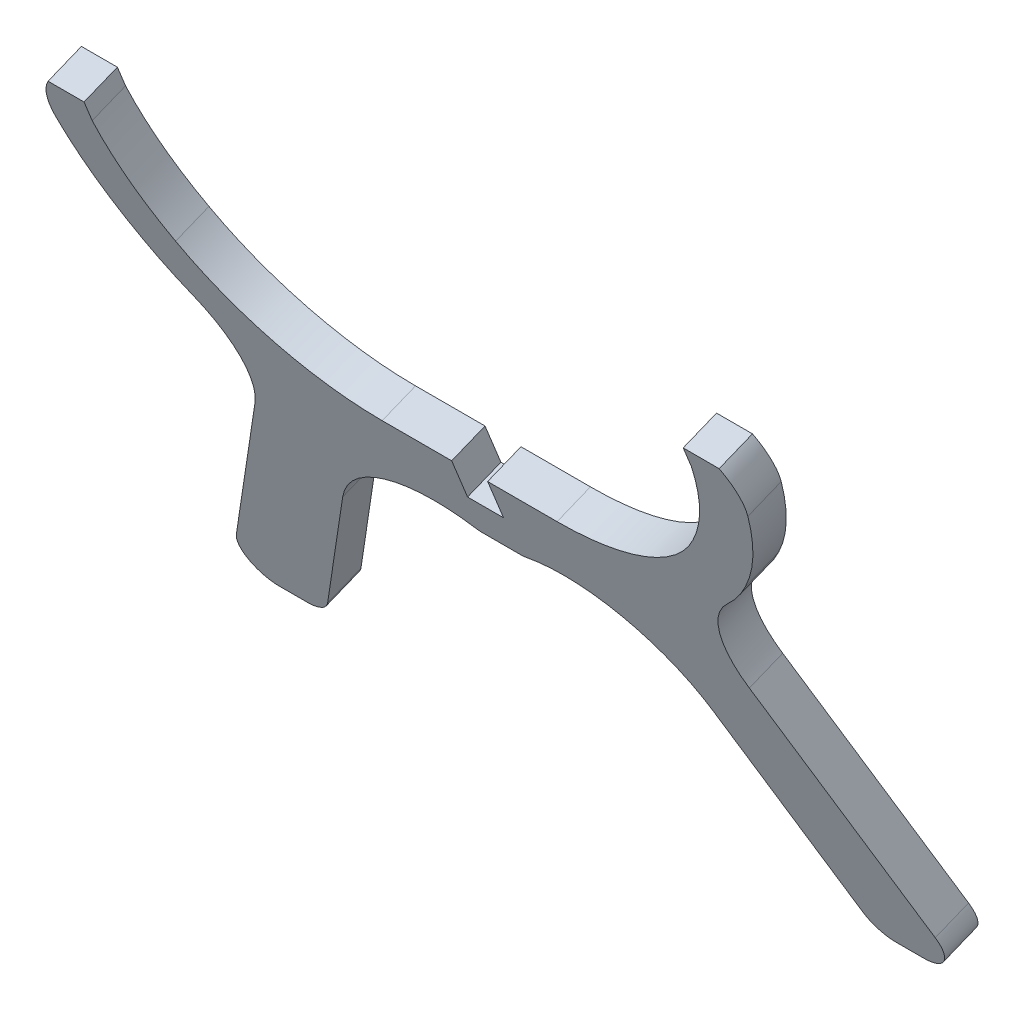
ISO-10303-21;
HEADER;
FILE_DESCRIPTION(('STEP AP214'),'2;1');
FILE_NAME('part.step','',(''),(''),'','','');
FILE_SCHEMA(('AUTOMOTIVE_DESIGN { 1 0 10303 214 1 1 1 1 }'));
ENDSEC;
DATA;
#1=APPLICATION_CONTEXT('core data for automotive mechanical design processes');
#2=APPLICATION_PROTOCOL_DEFINITION('international standard','automotive_design',2000,#1);
#3=PRODUCT_CONTEXT('',#1,'mechanical');
#4=PRODUCT('Part','Part','',(#3));
#5=PRODUCT_RELATED_PRODUCT_CATEGORY('part','',(#4));
#6=PRODUCT_DEFINITION_FORMATION('','',#4);
#7=PRODUCT_DEFINITION_CONTEXT('part definition',#1,'design');
#8=PRODUCT_DEFINITION('design','',#6,#7);
#9=PRODUCT_DEFINITION_SHAPE('','',#8);
#10=(LENGTH_UNIT() NAMED_UNIT(*) SI_UNIT(.MILLI.,.METRE.));
#11=(NAMED_UNIT(*) PLANE_ANGLE_UNIT() SI_UNIT($,.RADIAN.));
#12=(NAMED_UNIT(*) SI_UNIT($,.STERADIAN.) SOLID_ANGLE_UNIT());
#13=UNCERTAINTY_MEASURE_WITH_UNIT(LENGTH_MEASURE(1.E-05),#10,'distance_accuracy_value','');
#14=(GEOMETRIC_REPRESENTATION_CONTEXT(3) GLOBAL_UNCERTAINTY_ASSIGNED_CONTEXT((#13)) GLOBAL_UNIT_ASSIGNED_CONTEXT((#10,
#11,#12)) REPRESENTATION_CONTEXT('',''));
#15=CARTESIAN_POINT('',(0.,0.,0.));
#16=DIRECTION('',(0.,0.,1.));
#17=DIRECTION('',(1.,0.,0.));
#18=AXIS2_PLACEMENT_3D('',#15,#16,#17);
#19=CARTESIAN_POINT('',(35.9135850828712,-188.81571690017,-95.7001268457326));
#20=DIRECTION('',(0.,-0.374606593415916,0.927183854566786));
#21=DIRECTION('',(0.,-0.927183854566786,-0.374606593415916));
#22=AXIS2_PLACEMENT_3D('',#19,#20,#21);
#23=CYLINDRICAL_SURFACE('',#22,265.895482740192);
#24=CARTESIAN_POINT('',(35.9135850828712,-202.301554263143,-62.3215080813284));
#25=DIRECTION('',(0.,-0.374606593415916,0.927183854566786));
#26=DIRECTION('',(0.,0.927183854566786,0.374606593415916));
#27=AXIS2_PLACEMENT_3D('',#24,#25,#26);
#28=CIRCLE('',#27,265.895482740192);
#29=CARTESIAN_POINT('',(259.051263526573,-336.374982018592,-116.490689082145));
#30=VERTEX_POINT('',#29);
#31=CARTESIAN_POINT('',(300.,-231.010933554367,-73.9208502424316));
#32=VERTEX_POINT('',#31);
#33=EDGE_CURVE('E297',#30,#32,#28,.T.);
#34=ORIENTED_EDGE('',*,*,#33,.T.);
#35=DIRECTION('',(0.,-0.374606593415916,0.927183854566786));
#36=VECTOR('',#35,1.);
#37=CARTESIAN_POINT('',(300.,-217.525096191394,-107.299469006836));
#38=LINE('',#37,#36);
#39=CARTESIAN_POINT('',(300.,-217.525096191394,-107.299469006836));
#40=VERTEX_POINT('',#39);
#41=EDGE_CURVE('E11',#40,#32,#38,.T.);
#42=ORIENTED_EDGE('',*,*,#41,.F.);
#43=CARTESIAN_POINT('',(35.9135850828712,-188.81571690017,-95.7001268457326));
#44=DIRECTION('',(0.,-0.374606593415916,0.927183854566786));
#45=DIRECTION('',(0.,0.927183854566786,0.374606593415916));
#46=AXIS2_PLACEMENT_3D('',#43,#44,#45);
#47=CIRCLE('',#46,265.895482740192);
#48=CARTESIAN_POINT('',(259.051263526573,-322.889144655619,-149.86930784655));
#49=VERTEX_POINT('',#48);
#50=EDGE_CURVE('E367',#49,#40,#47,.T.);
#51=ORIENTED_EDGE('',*,*,#50,.F.);
#52=DIRECTION('',(0.,-0.374606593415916,0.927183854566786));
#53=VECTOR('',#52,1.);
#54=CARTESIAN_POINT('',(259.051263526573,-322.889144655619,-149.86930784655));
#55=LINE('',#54,#53);
#56=EDGE_CURVE('E293',#49,#30,#55,.T.);
#57=ORIENTED_EDGE('',*,*,#56,.T.);
#58=EDGE_LOOP('',(#34,#42,#51,#57));
#59=FACE_BOUND('',#58,.T.);
#60=ADVANCED_FACE('F33',(#59),#23,.F.);
#61=CARTESIAN_POINT('',(300.,-217.525096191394,-107.299469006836));
#62=DIRECTION('',(1.,0.,0.));
#63=DIRECTION('',(0.,0.,-1.));
#64=AXIS2_PLACEMENT_3D('',#61,#62,#63);
#65=PLANE('',#64);
#66=DIRECTION('',(0.,0.927183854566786,0.374606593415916));
#67=VECTOR('',#66,1.);
#68=CARTESIAN_POINT('',(300.,-231.010933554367,-73.9208502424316));
#69=LINE('',#68,#67);
#70=CARTESIAN_POINT('',(300.,-210.723366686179,-65.7241411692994));
#71=VERTEX_POINT('',#70);
#72=EDGE_CURVE('E300',#32,#71,#69,.T.);
#73=ORIENTED_EDGE('',*,*,#72,.T.);
#74=DIRECTION('',(0.,-0.374606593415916,0.927183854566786));
#75=VECTOR('',#74,1.);
#76=CARTESIAN_POINT('',(300.,-197.237529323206,-99.1027599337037));
#77=LINE('',#76,#75);
#78=CARTESIAN_POINT('',(300.,-197.237529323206,-99.1027599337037));
#79=VERTEX_POINT('',#78);
#80=EDGE_CURVE('E41',#79,#71,#77,.T.);
#81=ORIENTED_EDGE('',*,*,#80,.F.);
#82=DIRECTION('',(0.,0.927183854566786,0.374606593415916));
#83=VECTOR('',#82,1.);
#84=CARTESIAN_POINT('',(300.,-217.525096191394,-107.299469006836));
#85=LINE('',#84,#83);
#86=EDGE_CURVE('E176',#40,#79,#85,.T.);
#87=ORIENTED_EDGE('',*,*,#86,.F.);
#88=ORIENTED_EDGE('',*,*,#41,.T.);
#89=EDGE_LOOP('',(#73,#81,#87,#88));
#90=FACE_BOUND('',#89,.T.);
#91=ADVANCED_FACE('F565',(#90),#65,.F.);
#92=CARTESIAN_POINT('',(300.,-197.237529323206,-99.1027599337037));
#93=DIRECTION('',(0.,-0.927183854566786,-0.374606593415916));
#94=DIRECTION('',(0.,0.374606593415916,-0.927183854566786));
#95=AXIS2_PLACEMENT_3D('',#92,#93,#94);
#96=PLANE('',#95);
#97=DIRECTION('',(1.,0.,0.));
#98=VECTOR('',#97,1.);
#99=CARTESIAN_POINT('',(300.,-210.723366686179,-65.7241411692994));
#100=LINE('',#99,#98);
#101=CARTESIAN_POINT('',(336.,-210.723366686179,-65.7241411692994));
#102=VERTEX_POINT('',#101);
#103=EDGE_CURVE('E302',#71,#102,#100,.T.);
#104=ORIENTED_EDGE('',*,*,#103,.T.);
#105=DIRECTION('',(0.,-0.374606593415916,0.927183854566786));
#106=VECTOR('',#105,1.);
#107=CARTESIAN_POINT('',(336.,-197.237529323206,-99.1027599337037));
#108=LINE('',#107,#106);
#109=CARTESIAN_POINT('',(336.,-197.237529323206,-99.1027599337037));
#110=VERTEX_POINT('',#109);
#111=EDGE_CURVE('E458',#110,#102,#108,.T.);
#112=ORIENTED_EDGE('',*,*,#111,.F.);
#113=DIRECTION('',(1.,0.,0.));
#114=VECTOR('',#113,1.);
#115=CARTESIAN_POINT('',(300.,-197.237529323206,-99.1027599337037));
#116=LINE('',#115,#114);
#117=EDGE_CURVE('E466',#79,#110,#116,.T.);
#118=ORIENTED_EDGE('',*,*,#117,.F.);
#119=ORIENTED_EDGE('',*,*,#80,.T.);
#120=EDGE_LOOP('',(#104,#112,#118,#119));
#121=FACE_BOUND('',#120,.T.);
#122=ADVANCED_FACE('F464',(#121),#96,.F.);
#123=CARTESIAN_POINT('',(282.577068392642,-231.518029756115,-112.952981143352));
#124=DIRECTION('',(0.,-0.374606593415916,0.927183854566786));
#125=DIRECTION('',(0.,-0.927183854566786,-0.374606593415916));
#126=AXIS2_PLACEMENT_3D('',#123,#124,#125);
#127=CYLINDRICAL_SURFACE('',#126,64.9691539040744);
#128=CARTESIAN_POINT('',(282.577068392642,-245.003867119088,-79.574362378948));
#129=DIRECTION('',(0.,0.374606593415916,-0.927183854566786));
#130=DIRECTION('',(0.,0.927183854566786,0.374606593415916));
#131=AXIS2_PLACEMENT_3D('',#128,#129,#130);
#132=CIRCLE('',#131,64.9691539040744);
#133=CARTESIAN_POINT('',(346.44249807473,-256.060232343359,-84.0414238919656));
#134=VERTEX_POINT('',#133);
#135=EDGE_CURVE('E304',#102,#134,#132,.T.);
#136=ORIENTED_EDGE('',*,*,#135,.T.);
#137=DIRECTION('',(0.,-0.374606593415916,0.927183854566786));
#138=VECTOR('',#137,1.);
#139=CARTESIAN_POINT('',(346.44249807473,-242.574394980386,-117.42004265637));
#140=LINE('',#139,#138);
#141=CARTESIAN_POINT('',(346.44249807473,-242.574394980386,-117.42004265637));
#142=VERTEX_POINT('',#141);
#143=EDGE_CURVE('E455',#142,#134,#140,.T.);
#144=ORIENTED_EDGE('',*,*,#143,.F.);
#145=CARTESIAN_POINT('',(282.577068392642,-231.518029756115,-112.952981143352));
#146=DIRECTION('',(0.,0.374606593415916,-0.927183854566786));
#147=DIRECTION('',(0.,0.927183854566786,0.374606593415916));
#148=AXIS2_PLACEMENT_3D('',#145,#146,#147);
#149=CIRCLE('',#148,64.9691539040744);
#150=EDGE_CURVE('E484',#110,#142,#149,.T.);
#151=ORIENTED_EDGE('',*,*,#150,.F.);
#152=ORIENTED_EDGE('',*,*,#111,.T.);
#153=EDGE_LOOP('',(#136,#144,#151,#152));
#154=FACE_BOUND('',#153,.T.);
#155=ADVANCED_FACE('F475',(#154),#127,.T.);
#156=CARTESIAN_POINT('',(35.9135850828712,-188.81571690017,-95.7001268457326));
#157=DIRECTION('',(0.,-0.374606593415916,0.927183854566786));
#158=DIRECTION('',(0.,-0.927183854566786,-0.374606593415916));
#159=AXIS2_PLACEMENT_3D('',#156,#157,#158);
#160=CYLINDRICAL_SURFACE('',#159,315.895482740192);
#161=CARTESIAN_POINT('',(35.9135850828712,-202.301554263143,-62.3215080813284));
#162=DIRECTION('',(0.,0.374606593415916,-0.927183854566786));
#163=DIRECTION('',(0.,0.927183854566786,0.374606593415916));
#164=AXIS2_PLACEMENT_3D('',#161,#162,#163);
#165=CIRCLE('',#164,315.895482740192);
#166=CARTESIAN_POINT('',(301.164181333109,-361.367172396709,-126.58818943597));
#167=VERTEX_POINT('',#166);
#168=EDGE_CURVE('E306',#134,#167,#165,.T.);
#169=ORIENTED_EDGE('',*,*,#168,.T.);
#170=DIRECTION('',(0.,-0.374606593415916,0.927183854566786));
#171=VECTOR('',#170,1.);
#172=CARTESIAN_POINT('',(301.164181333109,-347.881335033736,-159.966808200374));
#173=LINE('',#172,#171);
#174=CARTESIAN_POINT('',(301.164181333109,-347.881335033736,-159.966808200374));
#175=VERTEX_POINT('',#174);
#176=EDGE_CURVE('E452',#175,#167,#173,.T.);
#177=ORIENTED_EDGE('',*,*,#176,.F.);
#178=CARTESIAN_POINT('',(35.9135850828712,-188.81571690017,-95.7001268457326));
#179=DIRECTION('',(0.,0.374606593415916,-0.927183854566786));
#180=DIRECTION('',(0.,0.927183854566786,0.374606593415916));
#181=AXIS2_PLACEMENT_3D('',#178,#179,#180);
#182=CIRCLE('',#181,315.895482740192);
#183=EDGE_CURVE('E481',#142,#175,#182,.T.);
#184=ORIENTED_EDGE('',*,*,#183,.F.);
#185=ORIENTED_EDGE('',*,*,#143,.T.);
#186=EDGE_LOOP('',(#169,#177,#184,#185));
#187=FACE_BOUND('',#186,.T.);
#188=ADVANCED_FACE('F479',(#187),#160,.T.);
#189=CARTESIAN_POINT('',(87.5793017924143,-222.417987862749,-109.276325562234));
#190=DIRECTION('',(0.,-0.374606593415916,0.927183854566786));
#191=DIRECTION('',(0.,-0.927183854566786,-0.374606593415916));
#192=AXIS2_PLACEMENT_3D('',#189,#190,#191);
#193=CYLINDRICAL_SURFACE('',#192,252.842000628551);
#194=CARTESIAN_POINT('',(87.5793017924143,-235.903825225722,-75.8977067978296));
#195=DIRECTION('',(0.,0.374606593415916,-0.927183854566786));
#196=DIRECTION('',(0.,0.927183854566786,0.374606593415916));
#197=AXIS2_PLACEMENT_3D('',#194,#195,#196);
#198=CIRCLE('',#197,252.842000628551);
#199=CARTESIAN_POINT('',(267.327943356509,-400.774486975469,-142.509778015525));
#200=VERTEX_POINT('',#199);
#201=EDGE_CURVE('E308',#167,#200,#198,.T.);
#202=ORIENTED_EDGE('',*,*,#201,.T.);
#203=DIRECTION('',(0.,-0.374606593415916,0.927183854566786));
#204=VECTOR('',#203,1.);
#205=CARTESIAN_POINT('',(267.327943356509,-387.288649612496,-175.88839677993));
#206=LINE('',#205,#204);
#207=CARTESIAN_POINT('',(267.327943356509,-387.288649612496,-175.88839677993));
#208=VERTEX_POINT('',#207);
#209=EDGE_CURVE('E449',#208,#200,#206,.T.);
#210=ORIENTED_EDGE('',*,*,#209,.F.);
#211=CARTESIAN_POINT('',(87.5793017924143,-222.417987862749,-109.276325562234));
#212=DIRECTION('',(0.,0.374606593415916,-0.927183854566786));
#213=DIRECTION('',(0.,0.927183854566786,0.374606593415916));
#214=AXIS2_PLACEMENT_3D('',#211,#212,#213);
#215=CIRCLE('',#214,252.842000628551);
#216=EDGE_CURVE('E483',#175,#208,#215,.T.);
#217=ORIENTED_EDGE('',*,*,#216,.F.);
#218=ORIENTED_EDGE('',*,*,#176,.T.);
#219=EDGE_LOOP('',(#202,#210,#217,#218));
#220=FACE_BOUND('',#219,.T.);
#221=ADVANCED_FACE('F578',(#220),#193,.T.);
#222=CARTESIAN_POINT('',(338.419234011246,-452.495641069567,-202.233731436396));
#223=DIRECTION('',(0.,-0.374606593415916,0.927183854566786));
#224=DIRECTION('',(0.,-0.927183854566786,-0.374606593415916));
#225=AXIS2_PLACEMENT_3D('',#222,#223,#224);
#226=CYLINDRICAL_SURFACE('',#225,100.);
#227=CARTESIAN_POINT('',(338.419234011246,-465.98147843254,-168.855112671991));
#228=DIRECTION('',(0.,-0.374606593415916,0.927183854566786));
#229=DIRECTION('',(0.,0.927183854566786,0.374606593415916));
#230=AXIS2_PLACEMENT_3D('',#227,#228,#229);
#231=CIRCLE('',#230,100.);
#232=CARTESIAN_POINT('',(247.513299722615,-504.614139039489,-184.463720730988));
#233=VERTEX_POINT('',#232);
#234=EDGE_CURVE('E310',#200,#233,#231,.T.);
#235=ORIENTED_EDGE('',*,*,#234,.T.);
#236=DIRECTION('',(0.,-0.374606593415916,0.927183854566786));
#237=VECTOR('',#236,1.);
#238=CARTESIAN_POINT('',(247.513299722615,-491.128301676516,-217.842339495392));
#239=LINE('',#238,#237);
#240=CARTESIAN_POINT('',(247.513299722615,-491.128301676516,-217.842339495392));
#241=VERTEX_POINT('',#240);
#242=EDGE_CURVE('E446',#241,#233,#239,.T.);
#243=ORIENTED_EDGE('',*,*,#242,.F.);
#244=CARTESIAN_POINT('',(338.419234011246,-452.495641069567,-202.233731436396));
#245=DIRECTION('',(0.,-0.374606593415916,0.927183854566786));
#246=DIRECTION('',(0.,0.927183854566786,0.374606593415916));
#247=AXIS2_PLACEMENT_3D('',#244,#245,#246);
#248=CIRCLE('',#247,100.);
#249=EDGE_CURVE('E486',#208,#241,#248,.T.);
#250=ORIENTED_EDGE('',*,*,#249,.F.);
#251=ORIENTED_EDGE('',*,*,#209,.T.);
#252=EDGE_LOOP('',(#235,#243,#250,#251));
#253=FACE_BOUND('',#252,.T.);
#254=ADVANCED_FACE('F581',(#253),#226,.F.);
#255=CARTESIAN_POINT('',(247.513299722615,-491.128301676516,-217.842339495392));
#256=DIRECTION('',(-0.909059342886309,-0.386326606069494,-0.156086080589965));
#257=DIRECTION('',(0.391120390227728,-0.920339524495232,0.));
#258=AXIS2_PLACEMENT_3D('',#255,#256,#257);
#259=PLANE('',#258);
#260=DIRECTION('',(0.416666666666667,-0.842865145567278,-0.340539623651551));
#261=VECTOR('',#260,1.);
#262=CARTESIAN_POINT('',(247.513299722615,-504.614139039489,-184.463720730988));
#263=LINE('',#262,#261);
#264=CARTESIAN_POINT('',(349.946217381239,-711.82326556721,-268.181642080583));
#265=VERTEX_POINT('',#264);
#266=EDGE_CURVE('E312',#233,#265,#263,.T.);
#267=ORIENTED_EDGE('',*,*,#266,.T.);
#268=DIRECTION('',(0.,-0.374606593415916,0.927183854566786));
#269=VECTOR('',#268,1.);
#270=CARTESIAN_POINT('',(349.946217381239,-698.337428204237,-301.560260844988));
#271=LINE('',#270,#269);
#272=CARTESIAN_POINT('',(349.946217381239,-698.337428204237,-301.560260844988));
#273=VERTEX_POINT('',#272);
#274=EDGE_CURVE('E443',#273,#265,#271,.T.);
#275=ORIENTED_EDGE('',*,*,#274,.F.);
#276=DIRECTION('',(0.416666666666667,-0.842865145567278,-0.340539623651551));
#277=VECTOR('',#276,1.);
#278=CARTESIAN_POINT('',(247.513299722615,-491.128301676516,-217.842339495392));
#279=LINE('',#278,#277);
#280=EDGE_CURVE('E492',#241,#273,#279,.T.);
#281=ORIENTED_EDGE('',*,*,#280,.F.);
#282=ORIENTED_EDGE('',*,*,#242,.T.);
#283=EDGE_LOOP('',(#267,#275,#281,#282));
#284=FACE_BOUND('',#283,.T.);
#285=ADVANCED_FACE('F585',(#284),#259,.F.);
#286=CARTESIAN_POINT('',(322.67443709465,-709.927226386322,-306.242843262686));
#287=DIRECTION('',(0.,-0.374606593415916,0.927183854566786));
#288=DIRECTION('',(0.,-0.927183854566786,-0.374606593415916));
#289=AXIS2_PLACEMENT_3D('',#286,#287,#288);
#290=CYLINDRICAL_SURFACE('',#289,30.);
#291=CARTESIAN_POINT('',(322.67443709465,-723.413063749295,-272.864224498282));
#292=DIRECTION('',(0.,0.374606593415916,-0.927183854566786));
#293=DIRECTION('',(0.,0.927183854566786,0.374606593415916));
#294=AXIS2_PLACEMENT_3D('',#291,#292,#293);
#295=CIRCLE('',#294,30.);
#296=CARTESIAN_POINT('',(322.67443709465,-751.228579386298,-284.10242230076));
#297=VERTEX_POINT('',#296);
#298=EDGE_CURVE('E314',#265,#297,#295,.T.);
#299=ORIENTED_EDGE('',*,*,#298,.T.);
#300=DIRECTION('',(0.,-0.374606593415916,0.927183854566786));
#301=VECTOR('',#300,1.);
#302=CARTESIAN_POINT('',(322.67443709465,-737.742742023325,-317.481041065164));
#303=LINE('',#302,#301);
#304=CARTESIAN_POINT('',(322.67443709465,-737.742742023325,-317.481041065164));
#305=VERTEX_POINT('',#304);
#306=EDGE_CURVE('E440',#305,#297,#303,.T.);
#307=ORIENTED_EDGE('',*,*,#306,.F.);
#308=CARTESIAN_POINT('',(322.67443709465,-709.927226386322,-306.242843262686));
#309=DIRECTION('',(0.,0.374606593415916,-0.927183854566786));
#310=DIRECTION('',(0.,0.927183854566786,0.374606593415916));
#311=AXIS2_PLACEMENT_3D('',#308,#309,#310);
#312=CIRCLE('',#311,30.);
#313=EDGE_CURVE('E494',#273,#305,#312,.T.);
#314=ORIENTED_EDGE('',*,*,#313,.F.);
#315=ORIENTED_EDGE('',*,*,#274,.T.);
#316=EDGE_LOOP('',(#299,#307,#314,#315));
#317=FACE_BOUND('',#316,.T.);
#318=ADVANCED_FACE('F589',(#317),#290,.T.);
#319=CARTESIAN_POINT('',(322.67443709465,-737.742742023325,-317.481041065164));
#320=DIRECTION('',(0.,0.927183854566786,0.374606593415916));
#321=DIRECTION('',(0.,-0.374606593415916,0.927183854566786));
#322=AXIS2_PLACEMENT_3D('',#319,#320,#321);
#323=PLANE('',#322);
#324=DIRECTION('',(-1.,0.,0.));
#325=VECTOR('',#324,1.);
#326=CARTESIAN_POINT('',(322.67443709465,-751.228579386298,-284.10242230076));
#327=LINE('',#326,#325);
#328=CARTESIAN_POINT('',(295.173482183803,-751.228579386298,-284.10242230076));
#329=VERTEX_POINT('',#328);
#330=EDGE_CURVE('E316',#297,#329,#327,.T.);
#331=ORIENTED_EDGE('',*,*,#330,.T.);
#332=DIRECTION('',(0.,-0.374606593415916,0.927183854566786));
#333=VECTOR('',#332,1.);
#334=CARTESIAN_POINT('',(295.173482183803,-737.742742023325,-317.481041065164));
#335=LINE('',#334,#333);
#336=CARTESIAN_POINT('',(295.173482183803,-737.742742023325,-317.481041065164));
#337=VERTEX_POINT('',#336);
#338=EDGE_CURVE('E437',#337,#329,#335,.T.);
#339=ORIENTED_EDGE('',*,*,#338,.F.);
#340=DIRECTION('',(-1.,0.,0.));
#341=VECTOR('',#340,1.);
#342=CARTESIAN_POINT('',(322.67443709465,-737.742742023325,-317.481041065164));
#343=LINE('',#342,#341);
#344=EDGE_CURVE('E496',#305,#337,#343,.T.);
#345=ORIENTED_EDGE('',*,*,#344,.F.);
#346=ORIENTED_EDGE('',*,*,#306,.T.);
#347=EDGE_LOOP('',(#331,#339,#345,#346));
#348=FACE_BOUND('',#347,.T.);
#349=ADVANCED_FACE('F593',(#348),#323,.F.);
#350=CARTESIAN_POINT('',(295.173482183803,-709.927226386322,-306.242843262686));
#351=DIRECTION('',(0.,-0.374606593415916,0.927183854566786));
#352=DIRECTION('',(0.,-0.927183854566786,-0.374606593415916));
#353=AXIS2_PLACEMENT_3D('',#350,#351,#352);
#354=CYLINDRICAL_SURFACE('',#353,30.);
#355=CARTESIAN_POINT('',(295.173482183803,-723.413063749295,-272.864224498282));
#356=DIRECTION('',(0.,0.374606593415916,-0.927183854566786));
#357=DIRECTION('',(0.,-0.927183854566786,-0.374606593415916));
#358=AXIS2_PLACEMENT_3D('',#355,#356,#357);
#359=CIRCLE('',#358,30.);
#360=CARTESIAN_POINT('',(267.901701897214,-735.002861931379,-277.546806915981));
#361=VERTEX_POINT('',#360);
#362=EDGE_CURVE('E318',#329,#361,#359,.T.);
#363=ORIENTED_EDGE('',*,*,#362,.T.);
#364=DIRECTION('',(0.,-0.374606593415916,0.927183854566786));
#365=VECTOR('',#364,1.);
#366=CARTESIAN_POINT('',(267.901701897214,-721.517024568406,-310.925425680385));
#367=LINE('',#366,#365);
#368=CARTESIAN_POINT('',(267.901701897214,-721.517024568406,-310.925425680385));
#369=VERTEX_POINT('',#368);
#370=EDGE_CURVE('E434',#369,#361,#367,.T.);
#371=ORIENTED_EDGE('',*,*,#370,.F.);
#372=CARTESIAN_POINT('',(295.173482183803,-709.927226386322,-306.242843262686));
#373=DIRECTION('',(0.,0.374606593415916,-0.927183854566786));
#374=DIRECTION('',(0.,-0.927183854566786,-0.374606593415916));
#375=AXIS2_PLACEMENT_3D('',#372,#373,#374);
#376=CIRCLE('',#375,30.);
#377=EDGE_CURVE('E498',#337,#369,#376,.T.);
#378=ORIENTED_EDGE('',*,*,#377,.F.);
#379=ORIENTED_EDGE('',*,*,#338,.T.);
#380=EDGE_LOOP('',(#363,#371,#378,#379));
#381=FACE_BOUND('',#380,.T.);
#382=ADVANCED_FACE('F597',(#381),#354,.T.);
#383=CARTESIAN_POINT('',(185.470632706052,-554.769164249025,-243.554917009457));
#384=DIRECTION('',(0.90905934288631,0.386326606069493,0.156086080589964));
#385=DIRECTION('',(-0.391120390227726,0.920339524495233,0.));
#386=AXIS2_PLACEMENT_3D('',#383,#384,#385);
#387=PLANE('',#386);
#388=DIRECTION('',(-0.416666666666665,0.842865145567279,0.340539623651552));
#389=VECTOR('',#388,1.);
#390=CARTESIAN_POINT('',(185.470632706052,-568.255001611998,-210.176298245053));
#391=LINE('',#390,#389);
#392=CARTESIAN_POINT('',(185.470632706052,-568.255001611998,-210.176298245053));
#393=VERTEX_POINT('',#392);
#394=EDGE_CURVE('E320',#361,#393,#391,.T.);
#395=ORIENTED_EDGE('',*,*,#394,.T.);
#396=DIRECTION('',(0.,-0.374606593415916,0.927183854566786));
#397=VECTOR('',#396,1.);
#398=CARTESIAN_POINT('',(185.470632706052,-554.769164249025,-243.554917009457));
#399=LINE('',#398,#397);
#400=CARTESIAN_POINT('',(185.470632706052,-554.769164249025,-243.554917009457));
#401=VERTEX_POINT('',#400);
#402=EDGE_CURVE('E431',#401,#393,#399,.T.);
#403=ORIENTED_EDGE('',*,*,#402,.F.);
#404=DIRECTION('',(-0.416666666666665,0.842865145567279,0.340539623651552));
#405=VECTOR('',#404,1.);
#406=CARTESIAN_POINT('',(185.470632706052,-554.769164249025,-243.554917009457));
#407=LINE('',#406,#405);
#408=EDGE_CURVE('E500',#369,#401,#407,.T.);
#409=ORIENTED_EDGE('',*,*,#408,.F.);
#410=ORIENTED_EDGE('',*,*,#370,.T.);
#411=EDGE_LOOP('',(#395,#403,#409,#410));
#412=FACE_BOUND('',#411,.T.);
#413=ADVANCED_FACE('F601',(#412),#387,.F.);
#414=CARTESIAN_POINT('',(64.7078103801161,-606.090226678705,-264.289972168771));
#415=DIRECTION('',(0.,-0.374606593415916,0.927183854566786));
#416=DIRECTION('',(0.,-0.927183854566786,-0.374606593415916));
#417=AXIS2_PLACEMENT_3D('',#414,#415,#416);
#418=CYLINDRICAL_SURFACE('',#417,132.843717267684);
#419=CARTESIAN_POINT('',(64.7078103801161,-619.576064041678,-230.911353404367));
#420=DIRECTION('',(0.,-0.374606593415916,0.927183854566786));
#421=DIRECTION('',(0.,0.927183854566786,0.374606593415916));
#422=AXIS2_PLACEMENT_3D('',#419,#420,#421);
#423=CIRCLE('',#422,132.843717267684);
#424=CARTESIAN_POINT('',(25.2946497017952,-501.951340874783,-183.387880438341));
#425=VERTEX_POINT('',#424);
#426=EDGE_CURVE('E322',#393,#425,#423,.T.);
#427=ORIENTED_EDGE('',*,*,#426,.T.);
#428=DIRECTION('',(0.,-0.374606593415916,0.927183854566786));
#429=VECTOR('',#428,1.);
#430=CARTESIAN_POINT('',(25.2946497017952,-488.46550351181,-216.766499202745));
#431=LINE('',#430,#429);
#432=CARTESIAN_POINT('',(25.2946497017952,-488.46550351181,-216.766499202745));
#433=VERTEX_POINT('',#432);
#434=EDGE_CURVE('E428',#433,#425,#431,.T.);
#435=ORIENTED_EDGE('',*,*,#434,.F.);
#436=CARTESIAN_POINT('',(64.7078103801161,-606.090226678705,-264.289972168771));
#437=DIRECTION('',(0.,-0.374606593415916,0.927183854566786));
#438=DIRECTION('',(0.,0.927183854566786,0.374606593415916));
#439=AXIS2_PLACEMENT_3D('',#436,#437,#438);
#440=CIRCLE('',#439,132.843717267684);
#441=EDGE_CURVE('E502',#401,#433,#440,.T.);
#442=ORIENTED_EDGE('',*,*,#441,.F.);
#443=ORIENTED_EDGE('',*,*,#402,.T.);
#444=EDGE_LOOP('',(#427,#435,#442,#443));
#445=FACE_BOUND('',#444,.T.);
#446=ADVANCED_FACE('F605',(#445),#418,.F.);
#447=CARTESIAN_POINT('',(19.360886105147,-470.756766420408,-209.611704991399));
#448=DIRECTION('',(0.,-0.374606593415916,0.927183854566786));
#449=DIRECTION('',(0.,-0.927183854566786,-0.374606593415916));
#450=AXIS2_PLACEMENT_3D('',#447,#448,#449);
#451=CYLINDRICAL_SURFACE('',#450,20.);
#452=CARTESIAN_POINT('',(19.360886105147,-484.242603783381,-176.233086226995));
#453=DIRECTION('',(0.,0.374606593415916,-0.927183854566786));
#454=DIRECTION('',(0.,0.927183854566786,0.374606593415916));
#455=AXIS2_PLACEMENT_3D('',#452,#453,#454);
#456=CIRCLE('',#455,20.);
#457=CARTESIAN_POINT('',(19.360886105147,-502.786280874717,-183.725218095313));
#458=VERTEX_POINT('',#457);
#459=EDGE_CURVE('E324',#425,#458,#456,.T.);
#460=ORIENTED_EDGE('',*,*,#459,.T.);
#461=DIRECTION('',(0.,-0.374606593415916,0.927183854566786));
#462=VECTOR('',#461,1.);
#463=CARTESIAN_POINT('',(19.360886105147,-489.300443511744,-217.103836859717));
#464=LINE('',#463,#462);
#465=CARTESIAN_POINT('',(19.360886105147,-489.300443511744,-217.103836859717));
#466=VERTEX_POINT('',#465);
#467=EDGE_CURVE('E425',#466,#458,#464,.T.);
#468=ORIENTED_EDGE('',*,*,#467,.F.);
#469=CARTESIAN_POINT('',(19.360886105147,-470.756766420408,-209.611704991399));
#470=DIRECTION('',(0.,0.374606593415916,-0.927183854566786));
#471=DIRECTION('',(0.,0.927183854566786,0.374606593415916));
#472=AXIS2_PLACEMENT_3D('',#469,#470,#471);
#473=CIRCLE('',#472,20.);
#474=EDGE_CURVE('E504',#433,#466,#473,.T.);
#475=ORIENTED_EDGE('',*,*,#474,.F.);
#476=ORIENTED_EDGE('',*,*,#434,.T.);
#477=EDGE_LOOP('',(#460,#468,#475,#476));
#478=FACE_BOUND('',#477,.T.);
#479=ADVANCED_FACE('F609',(#478),#451,.T.);
#480=CARTESIAN_POINT('',(19.360886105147,-489.300443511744,-217.103836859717));
#481=DIRECTION('',(0.,0.927183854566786,0.374606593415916));
#482=DIRECTION('',(0.,-0.374606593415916,0.927183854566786));
#483=AXIS2_PLACEMENT_3D('',#480,#481,#482);
#484=PLANE('',#483);
#485=DIRECTION('',(-1.,0.,0.));
#486=VECTOR('',#485,1.);
#487=CARTESIAN_POINT('',(19.360886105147,-502.786280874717,-183.725218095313));
#488=LINE('',#487,#486);
#489=CARTESIAN_POINT('',(-19.360886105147,-502.786280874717,-183.725218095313));
#490=VERTEX_POINT('',#489);
#491=EDGE_CURVE('E326',#458,#490,#488,.T.);
#492=ORIENTED_EDGE('',*,*,#491,.T.);
#493=DIRECTION('',(0.,-0.374606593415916,0.927183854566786));
#494=VECTOR('',#493,1.);
#495=CARTESIAN_POINT('',(-19.360886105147,-489.300443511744,-217.103836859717));
#496=LINE('',#495,#494);
#497=CARTESIAN_POINT('',(-19.360886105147,-489.300443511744,-217.103836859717));
#498=VERTEX_POINT('',#497);
#499=EDGE_CURVE('E422',#498,#490,#496,.T.);
#500=ORIENTED_EDGE('',*,*,#499,.F.);
#501=DIRECTION('',(-1.,0.,0.));
#502=VECTOR('',#501,1.);
#503=CARTESIAN_POINT('',(19.360886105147,-489.300443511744,-217.103836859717));
#504=LINE('',#503,#502);
#505=EDGE_CURVE('E506',#466,#498,#504,.T.);
#506=ORIENTED_EDGE('',*,*,#505,.F.);
#507=ORIENTED_EDGE('',*,*,#467,.T.);
#508=EDGE_LOOP('',(#492,#500,#506,#507));
#509=FACE_BOUND('',#508,.T.);
#510=ADVANCED_FACE('F613',(#509),#484,.F.);
#511=CARTESIAN_POINT('',(-19.360886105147,-470.756766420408,-209.611704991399));
#512=DIRECTION('',(0.,-0.374606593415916,0.927183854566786));
#513=DIRECTION('',(0.,-0.927183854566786,-0.374606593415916));
#514=AXIS2_PLACEMENT_3D('',#511,#512,#513);
#515=CYLINDRICAL_SURFACE('',#514,20.);
#516=CARTESIAN_POINT('',(-19.360886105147,-484.242603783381,-176.233086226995));
#517=DIRECTION('',(0.,0.374606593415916,-0.927183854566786));
#518=DIRECTION('',(0.,-0.927183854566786,-0.374606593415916));
#519=AXIS2_PLACEMENT_3D('',#516,#517,#518);
#520=CIRCLE('',#519,20.);
#521=CARTESIAN_POINT('',(-25.2946497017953,-501.951340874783,-183.387880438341));
#522=VERTEX_POINT('',#521);
#523=EDGE_CURVE('E328',#490,#522,#520,.T.);
#524=ORIENTED_EDGE('',*,*,#523,.T.);
#525=DIRECTION('',(0.,-0.374606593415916,0.927183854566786));
#526=VECTOR('',#525,1.);
#527=CARTESIAN_POINT('',(-25.2946497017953,-488.46550351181,-216.766499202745));
#528=LINE('',#527,#526);
#529=CARTESIAN_POINT('',(-25.2946497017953,-488.46550351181,-216.766499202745));
#530=VERTEX_POINT('',#529);
#531=EDGE_CURVE('E419',#530,#522,#528,.T.);
#532=ORIENTED_EDGE('',*,*,#531,.F.);
#533=CARTESIAN_POINT('',(-19.360886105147,-470.756766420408,-209.611704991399));
#534=DIRECTION('',(0.,0.374606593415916,-0.927183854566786));
#535=DIRECTION('',(0.,-0.927183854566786,-0.374606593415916));
#536=AXIS2_PLACEMENT_3D('',#533,#534,#535);
#537=CIRCLE('',#536,20.);
#538=EDGE_CURVE('E508',#498,#530,#537,.T.);
#539=ORIENTED_EDGE('',*,*,#538,.F.);
#540=ORIENTED_EDGE('',*,*,#499,.T.);
#541=EDGE_LOOP('',(#524,#532,#539,#540));
#542=FACE_BOUND('',#541,.T.);
#543=ADVANCED_FACE('F617',(#542),#515,.T.);
#544=CARTESIAN_POINT('',(-64.7078103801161,-606.090226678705,-264.289972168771));
#545=DIRECTION('',(0.,-0.374606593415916,0.927183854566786));
#546=DIRECTION('',(0.,-0.927183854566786,-0.374606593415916));
#547=AXIS2_PLACEMENT_3D('',#544,#545,#546);
#548=CYLINDRICAL_SURFACE('',#547,132.843717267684);
#549=CARTESIAN_POINT('',(-64.7078103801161,-619.576064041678,-230.911353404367));
#550=DIRECTION('',(0.,-0.374606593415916,0.927183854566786));
#551=DIRECTION('',(0.,-0.927183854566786,-0.374606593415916));
#552=AXIS2_PLACEMENT_3D('',#549,#550,#551);
#553=CIRCLE('',#552,132.843717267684);
#554=CARTESIAN_POINT('',(-185.470632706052,-568.255001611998,-210.176298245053));
#555=VERTEX_POINT('',#554);
#556=EDGE_CURVE('E330',#522,#555,#553,.T.);
#557=ORIENTED_EDGE('',*,*,#556,.T.);
#558=DIRECTION('',(0.,-0.374606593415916,0.927183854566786));
#559=VECTOR('',#558,1.);
#560=CARTESIAN_POINT('',(-185.470632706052,-554.769164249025,-243.554917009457));
#561=LINE('',#560,#559);
#562=CARTESIAN_POINT('',(-185.470632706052,-554.769164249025,-243.554917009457));
#563=VERTEX_POINT('',#562);
#564=EDGE_CURVE('E416',#563,#555,#561,.T.);
#565=ORIENTED_EDGE('',*,*,#564,.F.);
#566=CARTESIAN_POINT('',(-64.7078103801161,-606.090226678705,-264.289972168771));
#567=DIRECTION('',(0.,-0.374606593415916,0.927183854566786));
#568=DIRECTION('',(0.,-0.927183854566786,-0.374606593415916));
#569=AXIS2_PLACEMENT_3D('',#566,#567,#568);
#570=CIRCLE('',#569,132.843717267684);
#571=EDGE_CURVE('E510',#530,#563,#570,.T.);
#572=ORIENTED_EDGE('',*,*,#571,.F.);
#573=ORIENTED_EDGE('',*,*,#531,.T.);
#574=EDGE_LOOP('',(#557,#565,#572,#573));
#575=FACE_BOUND('',#574,.T.);
#576=ADVANCED_FACE('F621',(#575),#548,.F.);
#577=CARTESIAN_POINT('',(-185.470632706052,-554.769164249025,-243.554917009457));
#578=DIRECTION('',(-0.90905934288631,0.386326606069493,0.156086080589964));
#579=DIRECTION('',(-0.391120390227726,-0.920339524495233,0.));
#580=AXIS2_PLACEMENT_3D('',#577,#578,#579);
#581=PLANE('',#580);
#582=DIRECTION('',(-0.416666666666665,-0.842865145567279,-0.340539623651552));
#583=VECTOR('',#582,1.);
#584=CARTESIAN_POINT('',(-185.470632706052,-568.255001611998,-210.176298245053));
#585=LINE('',#584,#583);
#586=CARTESIAN_POINT('',(-267.901701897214,-735.002861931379,-277.546806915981));
#587=VERTEX_POINT('',#586);
#588=EDGE_CURVE('E332',#555,#587,#585,.T.);
#589=ORIENTED_EDGE('',*,*,#588,.T.);
#590=DIRECTION('',(0.,-0.374606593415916,0.927183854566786));
#591=VECTOR('',#590,1.);
#592=CARTESIAN_POINT('',(-267.901701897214,-721.517024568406,-310.925425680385));
#593=LINE('',#592,#591);
#594=CARTESIAN_POINT('',(-267.901701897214,-721.517024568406,-310.925425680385));
#595=VERTEX_POINT('',#594);
#596=EDGE_CURVE('E413',#595,#587,#593,.T.);
#597=ORIENTED_EDGE('',*,*,#596,.F.);
#598=DIRECTION('',(-0.416666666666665,-0.842865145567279,-0.340539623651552));
#599=VECTOR('',#598,1.);
#600=CARTESIAN_POINT('',(-185.470632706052,-554.769164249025,-243.554917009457));
#601=LINE('',#600,#599);
#602=EDGE_CURVE('E512',#563,#595,#601,.T.);
#603=ORIENTED_EDGE('',*,*,#602,.F.);
#604=ORIENTED_EDGE('',*,*,#564,.T.);
#605=EDGE_LOOP('',(#589,#597,#603,#604));
#606=FACE_BOUND('',#605,.T.);
#607=ADVANCED_FACE('F625',(#606),#581,.F.);
#608=CARTESIAN_POINT('',(-295.173482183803,-709.927226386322,-306.242843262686));
#609=DIRECTION('',(0.,-0.374606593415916,0.927183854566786));
#610=DIRECTION('',(0.,-0.927183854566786,-0.374606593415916));
#611=AXIS2_PLACEMENT_3D('',#608,#609,#610);
#612=CYLINDRICAL_SURFACE('',#611,30.);
#613=CARTESIAN_POINT('',(-295.173482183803,-723.413063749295,-272.864224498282));
#614=DIRECTION('',(0.,0.374606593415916,-0.927183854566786));
#615=DIRECTION('',(0.,0.927183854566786,0.374606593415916));
#616=AXIS2_PLACEMENT_3D('',#613,#614,#615);
#617=CIRCLE('',#616,30.);
#618=CARTESIAN_POINT('',(-295.173482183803,-751.228579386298,-284.10242230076));
#619=VERTEX_POINT('',#618);
#620=EDGE_CURVE('E334',#587,#619,#617,.T.);
#621=ORIENTED_EDGE('',*,*,#620,.T.);
#622=DIRECTION('',(0.,-0.374606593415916,0.927183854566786));
#623=VECTOR('',#622,1.);
#624=CARTESIAN_POINT('',(-295.173482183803,-737.742742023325,-317.481041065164));
#625=LINE('',#624,#623);
#626=CARTESIAN_POINT('',(-295.173482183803,-737.742742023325,-317.481041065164));
#627=VERTEX_POINT('',#626);
#628=EDGE_CURVE('E410',#627,#619,#625,.T.);
#629=ORIENTED_EDGE('',*,*,#628,.F.);
#630=CARTESIAN_POINT('',(-295.173482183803,-709.927226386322,-306.242843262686));
#631=DIRECTION('',(0.,0.374606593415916,-0.927183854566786));
#632=DIRECTION('',(0.,0.927183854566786,0.374606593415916));
#633=AXIS2_PLACEMENT_3D('',#630,#631,#632);
#634=CIRCLE('',#633,30.);
#635=EDGE_CURVE('E514',#595,#627,#634,.T.);
#636=ORIENTED_EDGE('',*,*,#635,.F.);
#637=ORIENTED_EDGE('',*,*,#596,.T.);
#638=EDGE_LOOP('',(#621,#629,#636,#637));
#639=FACE_BOUND('',#638,.T.);
#640=ADVANCED_FACE('F629',(#639),#612,.T.);
#641=CARTESIAN_POINT('',(-322.67443709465,-737.742742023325,-317.481041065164));
#642=DIRECTION('',(0.,0.927183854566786,0.374606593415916));
#643=DIRECTION('',(0.,-0.374606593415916,0.927183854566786));
#644=AXIS2_PLACEMENT_3D('',#641,#642,#643);
#645=PLANE('',#644);
#646=DIRECTION('',(-1.,0.,0.));
#647=VECTOR('',#646,1.);
#648=CARTESIAN_POINT('',(-322.67443709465,-751.228579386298,-284.10242230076));
#649=LINE('',#648,#647);
#650=CARTESIAN_POINT('',(-322.67443709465,-751.228579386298,-284.10242230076));
#651=VERTEX_POINT('',#650);
#652=EDGE_CURVE('E336',#619,#651,#649,.T.);
#653=ORIENTED_EDGE('',*,*,#652,.T.);
#654=DIRECTION('',(0.,-0.374606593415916,0.927183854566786));
#655=VECTOR('',#654,1.);
#656=CARTESIAN_POINT('',(-322.67443709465,-737.742742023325,-317.481041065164));
#657=LINE('',#656,#655);
#658=CARTESIAN_POINT('',(-322.67443709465,-737.742742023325,-317.481041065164));
#659=VERTEX_POINT('',#658);
#660=EDGE_CURVE('E407',#659,#651,#657,.T.);
#661=ORIENTED_EDGE('',*,*,#660,.F.);
#662=DIRECTION('',(-1.,0.,0.));
#663=VECTOR('',#662,1.);
#664=CARTESIAN_POINT('',(-322.67443709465,-737.742742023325,-317.481041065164));
#665=LINE('',#664,#663);
#666=EDGE_CURVE('E516',#627,#659,#665,.T.);
#667=ORIENTED_EDGE('',*,*,#666,.F.);
#668=ORIENTED_EDGE('',*,*,#628,.T.);
#669=EDGE_LOOP('',(#653,#661,#667,#668));
#670=FACE_BOUND('',#669,.T.);
#671=ADVANCED_FACE('F633',(#670),#645,.F.);
#672=CARTESIAN_POINT('',(-322.67443709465,-709.927226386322,-306.242843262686));
#673=DIRECTION('',(0.,-0.374606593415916,0.927183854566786));
#674=DIRECTION('',(0.,-0.927183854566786,-0.374606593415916));
#675=AXIS2_PLACEMENT_3D('',#672,#673,#674);
#676=CYLINDRICAL_SURFACE('',#675,30.);
#677=CARTESIAN_POINT('',(-322.67443709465,-723.413063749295,-272.864224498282));
#678=DIRECTION('',(0.,0.374606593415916,-0.927183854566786));
#679=DIRECTION('',(0.,-0.927183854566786,-0.374606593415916));
#680=AXIS2_PLACEMENT_3D('',#677,#678,#679);
#681=CIRCLE('',#680,30.);
#682=CARTESIAN_POINT('',(-349.946217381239,-711.82326556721,-268.181642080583));
#683=VERTEX_POINT('',#682);
#684=EDGE_CURVE('E338',#651,#683,#681,.T.);
#685=ORIENTED_EDGE('',*,*,#684,.T.);
#686=DIRECTION('',(0.,-0.374606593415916,0.927183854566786));
#687=VECTOR('',#686,1.);
#688=CARTESIAN_POINT('',(-349.946217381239,-698.337428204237,-301.560260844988));
#689=LINE('',#688,#687);
#690=CARTESIAN_POINT('',(-349.946217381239,-698.337428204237,-301.560260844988));
#691=VERTEX_POINT('',#690);
#692=EDGE_CURVE('E404',#691,#683,#689,.T.);
#693=ORIENTED_EDGE('',*,*,#692,.F.);
#694=CARTESIAN_POINT('',(-322.67443709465,-709.927226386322,-306.242843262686));
#695=DIRECTION('',(0.,0.374606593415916,-0.927183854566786));
#696=DIRECTION('',(0.,-0.927183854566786,-0.374606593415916));
#697=AXIS2_PLACEMENT_3D('',#694,#695,#696);
#698=CIRCLE('',#697,30.);
#699=EDGE_CURVE('E518',#659,#691,#698,.T.);
#700=ORIENTED_EDGE('',*,*,#699,.F.);
#701=ORIENTED_EDGE('',*,*,#660,.T.);
#702=EDGE_LOOP('',(#685,#693,#700,#701));
#703=FACE_BOUND('',#702,.T.);
#704=ADVANCED_FACE('F637',(#703),#676,.T.);
#705=CARTESIAN_POINT('',(-247.513299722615,-491.128301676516,-217.842339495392));
#706=DIRECTION('',(0.909059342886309,-0.386326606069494,-0.156086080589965));
#707=DIRECTION('',(0.391120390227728,0.920339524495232,0.));
#708=AXIS2_PLACEMENT_3D('',#705,#706,#707);
#709=PLANE('',#708);
#710=DIRECTION('',(0.416666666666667,0.842865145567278,0.340539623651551));
#711=VECTOR('',#710,1.);
#712=CARTESIAN_POINT('',(-247.513299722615,-504.614139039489,-184.463720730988));
#713=LINE('',#712,#711);
#714=CARTESIAN_POINT('',(-247.513299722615,-504.614139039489,-184.463720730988));
#715=VERTEX_POINT('',#714);
#716=EDGE_CURVE('E340',#683,#715,#713,.T.);
#717=ORIENTED_EDGE('',*,*,#716,.T.);
#718=DIRECTION('',(0.,-0.374606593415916,0.927183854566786));
#719=VECTOR('',#718,1.);
#720=CARTESIAN_POINT('',(-247.513299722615,-491.128301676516,-217.842339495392));
#721=LINE('',#720,#719);
#722=CARTESIAN_POINT('',(-247.513299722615,-491.128301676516,-217.842339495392));
#723=VERTEX_POINT('',#722);
#724=EDGE_CURVE('E401',#723,#715,#721,.T.);
#725=ORIENTED_EDGE('',*,*,#724,.F.);
#726=DIRECTION('',(0.416666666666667,0.842865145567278,0.340539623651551));
#727=VECTOR('',#726,1.);
#728=CARTESIAN_POINT('',(-247.513299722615,-491.128301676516,-217.842339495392));
#729=LINE('',#728,#727);
#730=EDGE_CURVE('E520',#691,#723,#729,.T.);
#731=ORIENTED_EDGE('',*,*,#730,.F.);
#732=ORIENTED_EDGE('',*,*,#692,.T.);
#733=EDGE_LOOP('',(#717,#725,#731,#732));
#734=FACE_BOUND('',#733,.T.);
#735=ADVANCED_FACE('F641',(#734),#709,.F.);
#736=CARTESIAN_POINT('',(-338.419234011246,-452.495641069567,-202.233731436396));
#737=DIRECTION('',(0.,-0.374606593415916,0.927183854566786));
#738=DIRECTION('',(0.,-0.927183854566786,-0.374606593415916));
#739=AXIS2_PLACEMENT_3D('',#736,#737,#738);
#740=CYLINDRICAL_SURFACE('',#739,100.);
#741=CARTESIAN_POINT('',(-338.419234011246,-465.98147843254,-168.855112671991));
#742=DIRECTION('',(0.,-0.374606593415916,0.927183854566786));
#743=DIRECTION('',(0.,-0.927183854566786,-0.374606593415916));
#744=AXIS2_PLACEMENT_3D('',#741,#742,#743);
#745=CIRCLE('',#744,100.);
#746=CARTESIAN_POINT('',(-267.327943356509,-400.774486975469,-142.509778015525));
#747=VERTEX_POINT('',#746);
#748=EDGE_CURVE('E342',#715,#747,#745,.T.);
#749=ORIENTED_EDGE('',*,*,#748,.T.);
#750=DIRECTION('',(0.,-0.374606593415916,0.927183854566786));
#751=VECTOR('',#750,1.);
#752=CARTESIAN_POINT('',(-267.327943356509,-387.288649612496,-175.88839677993));
#753=LINE('',#752,#751);
#754=CARTESIAN_POINT('',(-267.327943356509,-387.288649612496,-175.88839677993));
#755=VERTEX_POINT('',#754);
#756=EDGE_CURVE('E398',#755,#747,#753,.T.);
#757=ORIENTED_EDGE('',*,*,#756,.F.);
#758=CARTESIAN_POINT('',(-338.419234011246,-452.495641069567,-202.233731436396));
#759=DIRECTION('',(0.,-0.374606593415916,0.927183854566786));
#760=DIRECTION('',(0.,-0.927183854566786,-0.374606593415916));
#761=AXIS2_PLACEMENT_3D('',#758,#759,#760);
#762=CIRCLE('',#761,100.);
#763=EDGE_CURVE('E522',#723,#755,#762,.T.);
#764=ORIENTED_EDGE('',*,*,#763,.F.);
#765=ORIENTED_EDGE('',*,*,#724,.T.);
#766=EDGE_LOOP('',(#749,#757,#764,#765));
#767=FACE_BOUND('',#766,.T.);
#768=ADVANCED_FACE('F645',(#767),#740,.F.);
#769=CARTESIAN_POINT('',(-87.5793017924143,-222.417987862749,-109.276325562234));
#770=DIRECTION('',(0.,-0.374606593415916,0.927183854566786));
#771=DIRECTION('',(0.,-0.927183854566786,-0.374606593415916));
#772=AXIS2_PLACEMENT_3D('',#769,#770,#771);
#773=CYLINDRICAL_SURFACE('',#772,252.842000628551);
#774=CARTESIAN_POINT('',(-87.5793017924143,-235.903825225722,-75.8977067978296));
#775=DIRECTION('',(0.,0.374606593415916,-0.927183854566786));
#776=DIRECTION('',(0.,-0.927183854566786,-0.374606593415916));
#777=AXIS2_PLACEMENT_3D('',#774,#775,#776);
#778=CIRCLE('',#777,252.842000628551);
#779=CARTESIAN_POINT('',(-301.164181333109,-361.367172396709,-126.58818943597));
#780=VERTEX_POINT('',#779);
#781=EDGE_CURVE('E344',#747,#780,#778,.T.);
#782=ORIENTED_EDGE('',*,*,#781,.T.);
#783=DIRECTION('',(0.,-0.374606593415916,0.927183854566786));
#784=VECTOR('',#783,1.);
#785=CARTESIAN_POINT('',(-301.164181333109,-347.881335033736,-159.966808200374));
#786=LINE('',#785,#784);
#787=CARTESIAN_POINT('',(-301.164181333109,-347.881335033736,-159.966808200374));
#788=VERTEX_POINT('',#787);
#789=EDGE_CURVE('E395',#788,#780,#786,.T.);
#790=ORIENTED_EDGE('',*,*,#789,.F.);
#791=CARTESIAN_POINT('',(-87.5793017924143,-222.417987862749,-109.276325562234));
#792=DIRECTION('',(0.,0.374606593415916,-0.927183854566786));
#793=DIRECTION('',(0.,-0.927183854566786,-0.374606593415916));
#794=AXIS2_PLACEMENT_3D('',#791,#792,#793);
#795=CIRCLE('',#794,252.842000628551);
#796=EDGE_CURVE('E524',#755,#788,#795,.T.);
#797=ORIENTED_EDGE('',*,*,#796,.F.);
#798=ORIENTED_EDGE('',*,*,#756,.T.);
#799=EDGE_LOOP('',(#782,#790,#797,#798));
#800=FACE_BOUND('',#799,.T.);
#801=ADVANCED_FACE('F649',(#800),#773,.T.);
#802=CARTESIAN_POINT('',(-35.9135850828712,-188.81571690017,-95.7001268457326));
#803=DIRECTION('',(0.,-0.374606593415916,0.927183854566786));
#804=DIRECTION('',(0.,-0.927183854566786,-0.374606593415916));
#805=AXIS2_PLACEMENT_3D('',#802,#803,#804);
#806=CYLINDRICAL_SURFACE('',#805,315.895482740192);
#807=CARTESIAN_POINT('',(-35.9135850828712,-202.301554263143,-62.3215080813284));
#808=DIRECTION('',(0.,0.374606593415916,-0.927183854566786));
#809=DIRECTION('',(0.,0.927183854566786,0.374606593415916));
#810=AXIS2_PLACEMENT_3D('',#807,#808,#809);
#811=CIRCLE('',#810,315.895482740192);
#812=CARTESIAN_POINT('',(-346.44249807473,-256.06023234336,-84.0414238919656));
#813=VERTEX_POINT('',#812);
#814=EDGE_CURVE('E346',#780,#813,#811,.T.);
#815=ORIENTED_EDGE('',*,*,#814,.T.);
#816=DIRECTION('',(0.,-0.374606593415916,0.927183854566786));
#817=VECTOR('',#816,1.);
#818=CARTESIAN_POINT('',(-346.44249807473,-242.574394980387,-117.42004265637));
#819=LINE('',#818,#817);
#820=CARTESIAN_POINT('',(-346.44249807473,-242.574394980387,-117.42004265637));
#821=VERTEX_POINT('',#820);
#822=EDGE_CURVE('E392',#821,#813,#819,.T.);
#823=ORIENTED_EDGE('',*,*,#822,.F.);
#824=CARTESIAN_POINT('',(-35.9135850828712,-188.81571690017,-95.7001268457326));
#825=DIRECTION('',(0.,0.374606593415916,-0.927183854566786));
#826=DIRECTION('',(0.,0.927183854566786,0.374606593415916));
#827=AXIS2_PLACEMENT_3D('',#824,#825,#826);
#828=CIRCLE('',#827,315.895482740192);
#829=EDGE_CURVE('E526',#788,#821,#828,.T.);
#830=ORIENTED_EDGE('',*,*,#829,.F.);
#831=ORIENTED_EDGE('',*,*,#789,.T.);
#832=EDGE_LOOP('',(#815,#823,#830,#831));
#833=FACE_BOUND('',#832,.T.);
#834=ADVANCED_FACE('F653',(#833),#806,.T.);
#835=CARTESIAN_POINT('',(-282.577068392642,-231.518029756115,-112.952981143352));
#836=DIRECTION('',(0.,-0.374606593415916,0.927183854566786));
#837=DIRECTION('',(0.,-0.927183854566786,-0.374606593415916));
#838=AXIS2_PLACEMENT_3D('',#835,#836,#837);
#839=CYLINDRICAL_SURFACE('',#838,64.9691539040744);
#840=CARTESIAN_POINT('',(-282.577068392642,-245.003867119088,-79.574362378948));
#841=DIRECTION('',(0.,0.374606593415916,-0.927183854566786));
#842=DIRECTION('',(0.,0.927183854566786,0.374606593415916));
#843=AXIS2_PLACEMENT_3D('',#840,#841,#842);
#844=CIRCLE('',#843,64.9691539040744);
#845=CARTESIAN_POINT('',(-336.,-210.72336668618,-65.7241411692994));
#846=VERTEX_POINT('',#845);
#847=EDGE_CURVE('E348',#813,#846,#844,.T.);
#848=ORIENTED_EDGE('',*,*,#847,.T.);
#849=DIRECTION('',(0.,-0.374606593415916,0.927183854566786));
#850=VECTOR('',#849,1.);
#851=CARTESIAN_POINT('',(-336.,-197.237529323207,-99.1027599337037));
#852=LINE('',#851,#850);
#853=CARTESIAN_POINT('',(-336.,-197.237529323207,-99.1027599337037));
#854=VERTEX_POINT('',#853);
#855=EDGE_CURVE('E389',#854,#846,#852,.T.);
#856=ORIENTED_EDGE('',*,*,#855,.F.);
#857=CARTESIAN_POINT('',(-282.577068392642,-231.518029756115,-112.952981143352));
#858=DIRECTION('',(0.,0.374606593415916,-0.927183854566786));
#859=DIRECTION('',(0.,0.927183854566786,0.374606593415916));
#860=AXIS2_PLACEMENT_3D('',#857,#858,#859);
#861=CIRCLE('',#860,64.9691539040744);
#862=EDGE_CURVE('E528',#821,#854,#861,.T.);
#863=ORIENTED_EDGE('',*,*,#862,.F.);
#864=ORIENTED_EDGE('',*,*,#822,.T.);
#865=EDGE_LOOP('',(#848,#856,#863,#864));
#866=FACE_BOUND('',#865,.T.);
#867=ADVANCED_FACE('F657',(#866),#839,.T.);
#868=CARTESIAN_POINT('',(-336.,-197.237529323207,-99.1027599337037));
#869=DIRECTION('',(0.,-0.927183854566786,-0.374606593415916));
#870=DIRECTION('',(0.,0.374606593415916,-0.927183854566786));
#871=AXIS2_PLACEMENT_3D('',#868,#869,#870);
#872=PLANE('',#871);
#873=DIRECTION('',(1.,0.,0.));
#874=VECTOR('',#873,1.);
#875=CARTESIAN_POINT('',(-336.,-210.72336668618,-65.7241411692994));
#876=LINE('',#875,#874);
#877=CARTESIAN_POINT('',(-300.,-210.723366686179,-65.7241411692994));
#878=VERTEX_POINT('',#877);
#879=EDGE_CURVE('E350',#846,#878,#876,.T.);
#880=ORIENTED_EDGE('',*,*,#879,.T.);
#881=DIRECTION('',(0.,-0.374606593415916,0.927183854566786));
#882=VECTOR('',#881,1.);
#883=CARTESIAN_POINT('',(-300.,-197.237529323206,-99.1027599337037));
#884=LINE('',#883,#882);
#885=CARTESIAN_POINT('',(-300.,-197.237529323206,-99.1027599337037));
#886=VERTEX_POINT('',#885);
#887=EDGE_CURVE('E386',#886,#878,#884,.T.);
#888=ORIENTED_EDGE('',*,*,#887,.F.);
#889=DIRECTION('',(1.,0.,0.));
#890=VECTOR('',#889,1.);
#891=CARTESIAN_POINT('',(-336.,-197.237529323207,-99.1027599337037));
#892=LINE('',#891,#890);
#893=EDGE_CURVE('E530',#854,#886,#892,.T.);
#894=ORIENTED_EDGE('',*,*,#893,.F.);
#895=ORIENTED_EDGE('',*,*,#855,.T.);
#896=EDGE_LOOP('',(#880,#888,#894,#895));
#897=FACE_BOUND('',#896,.T.);
#898=ADVANCED_FACE('F661',(#897),#872,.F.);
#899=CARTESIAN_POINT('',(-300.,-197.237529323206,-99.1027599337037));
#900=DIRECTION('',(-1.,0.,0.));
#901=DIRECTION('',(0.,0.,1.));
#902=AXIS2_PLACEMENT_3D('',#899,#900,#901);
#903=PLANE('',#902);
#904=DIRECTION('',(0.,-0.927183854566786,-0.374606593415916));
#905=VECTOR('',#904,1.);
#906=CARTESIAN_POINT('',(-300.,-210.723366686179,-65.7241411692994));
#907=LINE('',#906,#905);
#908=CARTESIAN_POINT('',(-300.,-231.010933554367,-73.9208502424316));
#909=VERTEX_POINT('',#908);
#910=EDGE_CURVE('E352',#878,#909,#907,.T.);
#911=ORIENTED_EDGE('',*,*,#910,.T.);
#912=DIRECTION('',(0.,-0.374606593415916,0.927183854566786));
#913=VECTOR('',#912,1.);
#914=CARTESIAN_POINT('',(-300.,-217.525096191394,-107.299469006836));
#915=LINE('',#914,#913);
#916=CARTESIAN_POINT('',(-300.,-217.525096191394,-107.299469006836));
#917=VERTEX_POINT('',#916);
#918=EDGE_CURVE('E383',#917,#909,#915,.T.);
#919=ORIENTED_EDGE('',*,*,#918,.F.);
#920=DIRECTION('',(0.,-0.927183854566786,-0.374606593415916));
#921=VECTOR('',#920,1.);
#922=CARTESIAN_POINT('',(-300.,-197.237529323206,-99.1027599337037));
#923=LINE('',#922,#921);
#924=EDGE_CURVE('E532',#886,#917,#923,.T.);
#925=ORIENTED_EDGE('',*,*,#924,.F.);
#926=ORIENTED_EDGE('',*,*,#887,.T.);
#927=EDGE_LOOP('',(#911,#919,#925,#926));
#928=FACE_BOUND('',#927,.T.);
#929=ADVANCED_FACE('F665',(#928),#903,.F.);
#930=CARTESIAN_POINT('',(-35.9135850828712,-188.81571690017,-95.7001268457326));
#931=DIRECTION('',(0.,-0.374606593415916,0.927183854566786));
#932=DIRECTION('',(0.,-0.927183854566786,-0.374606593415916));
#933=AXIS2_PLACEMENT_3D('',#930,#931,#932);
#934=CYLINDRICAL_SURFACE('',#933,265.895482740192);
#935=CARTESIAN_POINT('',(-35.9135850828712,-202.301554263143,-62.3215080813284));
#936=DIRECTION('',(0.,-0.374606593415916,0.927183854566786));
#937=DIRECTION('',(0.,0.927183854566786,0.374606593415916));
#938=AXIS2_PLACEMENT_3D('',#935,#936,#937);
#939=CIRCLE('',#938,265.895482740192);
#940=CARTESIAN_POINT('',(-259.051263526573,-336.374982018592,-116.490689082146));
#941=VERTEX_POINT('',#940);
#942=EDGE_CURVE('E354',#909,#941,#939,.T.);
#943=ORIENTED_EDGE('',*,*,#942,.T.);
#944=DIRECTION('',(0.,-0.374606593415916,0.927183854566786));
#945=VECTOR('',#944,1.);
#946=CARTESIAN_POINT('',(-259.051263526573,-322.889144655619,-149.86930784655));
#947=LINE('',#946,#945);
#948=CARTESIAN_POINT('',(-259.051263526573,-322.889144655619,-149.86930784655));
#949=VERTEX_POINT('',#948);
#950=EDGE_CURVE('E380',#949,#941,#947,.T.);
#951=ORIENTED_EDGE('',*,*,#950,.F.);
#952=CARTESIAN_POINT('',(-35.9135850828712,-188.81571690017,-95.7001268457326));
#953=DIRECTION('',(0.,-0.374606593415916,0.927183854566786));
#954=DIRECTION('',(0.,0.927183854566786,0.374606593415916));
#955=AXIS2_PLACEMENT_3D('',#952,#953,#954);
#956=CIRCLE('',#955,265.895482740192);
#957=EDGE_CURVE('E534',#917,#949,#956,.T.);
#958=ORIENTED_EDGE('',*,*,#957,.F.);
#959=ORIENTED_EDGE('',*,*,#918,.T.);
#960=EDGE_LOOP('',(#943,#951,#958,#959));
#961=FACE_BOUND('',#960,.T.);
#962=ADVANCED_FACE('F669',(#961),#934,.F.);
#963=CARTESIAN_POINT('',(-87.5793017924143,-222.417987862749,-109.276325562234));
#964=DIRECTION('',(0.,-0.374606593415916,0.927183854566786));
#965=DIRECTION('',(0.,-0.927183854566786,-0.374606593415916));
#966=AXIS2_PLACEMENT_3D('',#963,#964,#965);
#967=CYLINDRICAL_SURFACE('',#966,202.842000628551);
#968=CARTESIAN_POINT('',(-87.5793017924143,-235.903825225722,-75.8977067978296));
#969=DIRECTION('',(0.,-0.374606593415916,0.927183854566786));
#970=DIRECTION('',(0.,0.927183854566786,0.374606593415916));
#971=AXIS2_PLACEMENT_3D('',#968,#969,#970);
#972=CIRCLE('',#971,202.842000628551);
#973=CARTESIAN_POINT('',(-87.5793017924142,-423.97565323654,-151.88365765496));
#974=VERTEX_POINT('',#973);
#975=EDGE_CURVE('E356',#941,#974,#972,.T.);
#976=ORIENTED_EDGE('',*,*,#975,.T.);
#977=DIRECTION('',(0.,-0.374606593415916,0.927183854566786));
#978=VECTOR('',#977,1.);
#979=CARTESIAN_POINT('',(-87.5793017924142,-410.489815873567,-185.262276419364));
#980=LINE('',#979,#978);
#981=CARTESIAN_POINT('',(-87.5793017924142,-410.489815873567,-185.262276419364));
#982=VERTEX_POINT('',#981);
#983=EDGE_CURVE('E377',#982,#974,#980,.T.);
#984=ORIENTED_EDGE('',*,*,#983,.F.);
#985=CARTESIAN_POINT('',(-87.5793017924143,-222.417987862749,-109.276325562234));
#986=DIRECTION('',(0.,-0.374606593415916,0.927183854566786));
#987=DIRECTION('',(0.,0.927183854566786,0.374606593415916));
#988=AXIS2_PLACEMENT_3D('',#985,#986,#987);
#989=CIRCLE('',#988,202.842000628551);
#990=EDGE_CURVE('E536',#949,#982,#989,.T.);
#991=ORIENTED_EDGE('',*,*,#990,.F.);
#992=ORIENTED_EDGE('',*,*,#950,.T.);
#993=EDGE_LOOP('',(#976,#984,#991,#992));
#994=FACE_BOUND('',#993,.T.);
#995=ADVANCED_FACE('F673',(#994),#967,.F.);
#996=CARTESIAN_POINT('',(-87.5793017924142,-410.489815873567,-185.262276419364));
#997=DIRECTION('',(0.,-0.927183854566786,-0.374606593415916));
#998=DIRECTION('',(0.,0.374606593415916,-0.927183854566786));
#999=AXIS2_PLACEMENT_3D('',#996,#997,#998);
#1000=PLANE('',#999);
#1001=DIRECTION('',(1.,0.,0.));
#1002=VECTOR('',#1001,1.);
#1003=CARTESIAN_POINT('',(-87.5793017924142,-423.97565323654,-151.88365765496));
#1004=LINE('',#1003,#1002);
#1005=CARTESIAN_POINT('',(-18.,-423.97565323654,-151.88365765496));
#1006=VERTEX_POINT('',#1005);
#1007=EDGE_CURVE('E358',#974,#1006,#1004,.T.);
#1008=ORIENTED_EDGE('',*,*,#1007,.T.);
#1009=DIRECTION('',(0.,-0.374606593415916,0.927183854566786));
#1010=VECTOR('',#1009,1.);
#1011=CARTESIAN_POINT('',(-18.,-410.489815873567,-185.262276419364));
#1012=LINE('',#1011,#1010);
#1013=CARTESIAN_POINT('',(-18.,-410.489815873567,-185.262276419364));
#1014=VERTEX_POINT('',#1013);
#1015=EDGE_CURVE('E374',#1014,#1006,#1012,.T.);
#1016=ORIENTED_EDGE('',*,*,#1015,.F.);
#1017=DIRECTION('',(1.,0.,0.));
#1018=VECTOR('',#1017,1.);
#1019=CARTESIAN_POINT('',(-87.5793017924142,-410.489815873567,-185.262276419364));
#1020=LINE('',#1019,#1018);
#1021=EDGE_CURVE('E538',#982,#1014,#1020,.T.);
#1022=ORIENTED_EDGE('',*,*,#1021,.F.);
#1023=ORIENTED_EDGE('',*,*,#983,.T.);
#1024=EDGE_LOOP('',(#1008,#1016,#1022,#1023));
#1025=FACE_BOUND('',#1024,.T.);
#1026=ADVANCED_FACE('F677',(#1025),#1000,.F.);
#1027=CARTESIAN_POINT('',(-18.,-410.489815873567,-185.262276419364));
#1028=DIRECTION('',(-1.,0.,0.));
#1029=DIRECTION('',(0.,-1.,0.));
#1030=AXIS2_PLACEMENT_3D('',#1027,#1028,#1029);
#1031=PLANE('',#1030);
#1032=DIRECTION('',(0.,-0.927183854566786,-0.374606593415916));
#1033=VECTOR('',#1032,1.);
#1034=CARTESIAN_POINT('',(-18.,-423.97565323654,-151.88365765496));
#1035=LINE('',#1034,#1033);
#1036=CARTESIAN_POINT('',(-18.,-463.380967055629,-167.804437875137));
#1037=VERTEX_POINT('',#1036);
#1038=EDGE_CURVE('E360',#1006,#1037,#1035,.T.);
#1039=ORIENTED_EDGE('',*,*,#1038,.T.);
#1040=DIRECTION('',(0.,-0.374606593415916,0.927183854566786));
#1041=VECTOR('',#1040,1.);
#1042=CARTESIAN_POINT('',(-18.,-449.895129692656,-201.183056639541));
#1043=LINE('',#1042,#1041);
#1044=CARTESIAN_POINT('',(-18.,-449.895129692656,-201.183056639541));
#1045=VERTEX_POINT('',#1044);
#1046=EDGE_CURVE('E371',#1045,#1037,#1043,.T.);
#1047=ORIENTED_EDGE('',*,*,#1046,.F.);
#1048=DIRECTION('',(0.,-0.927183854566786,-0.374606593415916));
#1049=VECTOR('',#1048,1.);
#1050=CARTESIAN_POINT('',(-18.,-410.489815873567,-185.262276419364));
#1051=LINE('',#1050,#1049);
#1052=EDGE_CURVE('E540',#1014,#1045,#1051,.T.);
#1053=ORIENTED_EDGE('',*,*,#1052,.F.);
#1054=ORIENTED_EDGE('',*,*,#1015,.T.);
#1055=EDGE_LOOP('',(#1039,#1047,#1053,#1054));
#1056=FACE_BOUND('',#1055,.T.);
#1057=ADVANCED_FACE('F546',(#1056),#1031,.F.);
#1058=CARTESIAN_POINT('',(18.,-449.895129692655,-201.183056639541));
#1059=DIRECTION('',(0.,-0.927183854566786,-0.374606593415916));
#1060=DIRECTION('',(0.,0.374606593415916,-0.927183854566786));
#1061=AXIS2_PLACEMENT_3D('',#1058,#1059,#1060);
#1062=PLANE('',#1061);
#1063=DIRECTION('',(1.,0.,0.));
#1064=VECTOR('',#1063,1.);
#1065=CARTESIAN_POINT('',(18.,-463.380967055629,-167.804437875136));
#1066=LINE('',#1065,#1064);
#1067=CARTESIAN_POINT('',(18.,-463.380967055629,-167.804437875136));
#1068=VERTEX_POINT('',#1067);
#1069=EDGE_CURVE('E362',#1037,#1068,#1066,.T.);
#1070=ORIENTED_EDGE('',*,*,#1069,.T.);
#1071=DIRECTION('',(0.,-0.374606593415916,0.927183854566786));
#1072=VECTOR('',#1071,1.);
#1073=CARTESIAN_POINT('',(18.,-449.895129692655,-201.183056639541));
#1074=LINE('',#1073,#1072);
#1075=CARTESIAN_POINT('',(18.,-449.895129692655,-201.183056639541));
#1076=VERTEX_POINT('',#1075);
#1077=EDGE_CURVE('E288',#1076,#1068,#1074,.T.);
#1078=ORIENTED_EDGE('',*,*,#1077,.F.);
#1079=DIRECTION('',(1.,0.,0.));
#1080=VECTOR('',#1079,1.);
#1081=CARTESIAN_POINT('',(18.,-449.895129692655,-201.183056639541));
#1082=LINE('',#1081,#1080);
#1083=EDGE_CURVE('E279',#1045,#1076,#1082,.T.);
#1084=ORIENTED_EDGE('',*,*,#1083,.F.);
#1085=ORIENTED_EDGE('',*,*,#1046,.T.);
#1086=EDGE_LOOP('',(#1070,#1078,#1084,#1085));
#1087=FACE_BOUND('',#1086,.T.);
#1088=ADVANCED_FACE('F550',(#1087),#1062,.F.);
#1089=CARTESIAN_POINT('',(18.,-410.489815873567,-185.262276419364));
#1090=DIRECTION('',(1.,0.,0.));
#1091=DIRECTION('',(0.,1.,0.));
#1092=AXIS2_PLACEMENT_3D('',#1089,#1090,#1091);
#1093=PLANE('',#1092);
#1094=DIRECTION('',(0.,0.927183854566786,0.374606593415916));
#1095=VECTOR('',#1094,1.);
#1096=CARTESIAN_POINT('',(18.,-423.97565323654,-151.88365765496));
#1097=LINE('',#1096,#1095);
#1098=CARTESIAN_POINT('',(18.,-423.97565323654,-151.88365765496));
#1099=VERTEX_POINT('',#1098);
#1100=EDGE_CURVE('E287',#1068,#1099,#1097,.T.);
#1101=ORIENTED_EDGE('',*,*,#1100,.T.);
#1102=DIRECTION('',(0.,-0.374606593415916,0.927183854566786));
#1103=VECTOR('',#1102,1.);
#1104=CARTESIAN_POINT('',(18.,-410.489815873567,-185.262276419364));
#1105=LINE('',#1104,#1103);
#1106=CARTESIAN_POINT('',(18.,-410.489815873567,-185.262276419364));
#1107=VERTEX_POINT('',#1106);
#1108=EDGE_CURVE('E284',#1107,#1099,#1105,.T.);
#1109=ORIENTED_EDGE('',*,*,#1108,.F.);
#1110=DIRECTION('',(0.,0.927183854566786,0.374606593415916));
#1111=VECTOR('',#1110,1.);
#1112=CARTESIAN_POINT('',(18.,-410.489815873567,-185.262276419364));
#1113=LINE('',#1112,#1111);
#1114=EDGE_CURVE('E273',#1076,#1107,#1113,.T.);
#1115=ORIENTED_EDGE('',*,*,#1114,.F.);
#1116=ORIENTED_EDGE('',*,*,#1077,.T.);
#1117=EDGE_LOOP('',(#1101,#1109,#1115,#1116));
#1118=FACE_BOUND('',#1117,.T.);
#1119=ADVANCED_FACE('F285',(#1118),#1093,.F.);
#1120=CARTESIAN_POINT('',(18.,-410.489815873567,-185.262276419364));
#1121=DIRECTION('',(0.,-0.927183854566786,-0.374606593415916));
#1122=DIRECTION('',(0.,0.374606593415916,-0.927183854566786));
#1123=AXIS2_PLACEMENT_3D('',#1120,#1121,#1122);
#1124=PLANE('',#1123);
#1125=DIRECTION('',(1.,0.,0.));
#1126=VECTOR('',#1125,1.);
#1127=CARTESIAN_POINT('',(18.,-423.97565323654,-151.88365765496));
#1128=LINE('',#1127,#1126);
#1129=CARTESIAN_POINT('',(87.5793017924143,-423.97565323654,-151.88365765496));
#1130=VERTEX_POINT('',#1129);
#1131=EDGE_CURVE('E162',#1099,#1130,#1128,.T.);
#1132=ORIENTED_EDGE('',*,*,#1131,.T.);
#1133=DIRECTION('',(0.,-0.374606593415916,0.927183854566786));
#1134=VECTOR('',#1133,1.);
#1135=CARTESIAN_POINT('',(87.5793017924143,-410.489815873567,-185.262276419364));
#1136=LINE('',#1135,#1134);
#1137=CARTESIAN_POINT('',(87.5793017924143,-410.489815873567,-185.262276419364));
#1138=VERTEX_POINT('',#1137);
#1139=EDGE_CURVE('E289',#1138,#1130,#1136,.T.);
#1140=ORIENTED_EDGE('',*,*,#1139,.F.);
#1141=DIRECTION('',(1.,0.,0.));
#1142=VECTOR('',#1141,1.);
#1143=CARTESIAN_POINT('',(18.,-410.489815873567,-185.262276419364));
#1144=LINE('',#1143,#1142);
#1145=EDGE_CURVE('E277',#1107,#1138,#1144,.T.);
#1146=ORIENTED_EDGE('',*,*,#1145,.F.);
#1147=ORIENTED_EDGE('',*,*,#1108,.T.);
#1148=EDGE_LOOP('',(#1132,#1140,#1146,#1147));
#1149=FACE_BOUND('',#1148,.T.);
#1150=ADVANCED_FACE('F291',(#1149),#1124,.F.);
#1151=CARTESIAN_POINT('',(87.5793017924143,-222.417987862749,-109.276325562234));
#1152=DIRECTION('',(0.,-0.374606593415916,0.927183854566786));
#1153=DIRECTION('',(0.,-0.927183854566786,-0.374606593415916));
#1154=AXIS2_PLACEMENT_3D('',#1151,#1152,#1153);
#1155=CYLINDRICAL_SURFACE('',#1154,202.842000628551);
#1156=CARTESIAN_POINT('',(87.5793017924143,-235.903825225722,-75.8977067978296));
#1157=DIRECTION('',(0.,-0.374606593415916,0.927183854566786));
#1158=DIRECTION('',(0.,0.927183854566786,0.374606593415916));
#1159=AXIS2_PLACEMENT_3D('',#1156,#1157,#1158);
#1160=CIRCLE('',#1159,202.842000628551);
#1161=EDGE_CURVE('E168',#1130,#30,#1160,.T.);
#1162=ORIENTED_EDGE('',*,*,#1161,.T.);
#1163=ORIENTED_EDGE('',*,*,#56,.F.);
#1164=CARTESIAN_POINT('',(87.5793017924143,-222.417987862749,-109.276325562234));
#1165=DIRECTION('',(0.,-0.374606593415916,0.927183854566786));
#1166=DIRECTION('',(0.,0.927183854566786,0.374606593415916));
#1167=AXIS2_PLACEMENT_3D('',#1164,#1165,#1166);
#1168=CIRCLE('',#1167,202.842000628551);
#1169=EDGE_CURVE('E49',#1138,#49,#1168,.T.);
#1170=ORIENTED_EDGE('',*,*,#1169,.F.);
#1171=ORIENTED_EDGE('',*,*,#1139,.T.);
#1172=EDGE_LOOP('',(#1162,#1163,#1170,#1171));
#1173=FACE_BOUND('',#1172,.T.);
#1174=ADVANCED_FACE('F554',(#1173),#1155,.F.);
#1175=CARTESIAN_POINT('',(35.9135850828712,-188.81571690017,-95.7001268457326));
#1176=DIRECTION('',(0.,0.374606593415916,-0.927183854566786));
#1177=DIRECTION('',(0.,0.927183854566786,0.374606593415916));
#1178=AXIS2_PLACEMENT_3D('',#1175,#1176,#1177);
#1179=PLANE('',#1178);
#1180=ORIENTED_EDGE('',*,*,#50,.T.);
#1181=ORIENTED_EDGE('',*,*,#86,.T.);
#1182=ORIENTED_EDGE('',*,*,#117,.T.);
#1183=ORIENTED_EDGE('',*,*,#150,.T.);
#1184=ORIENTED_EDGE('',*,*,#183,.T.);
#1185=ORIENTED_EDGE('',*,*,#216,.T.);
#1186=ORIENTED_EDGE('',*,*,#249,.T.);
#1187=ORIENTED_EDGE('',*,*,#280,.T.);
#1188=ORIENTED_EDGE('',*,*,#313,.T.);
#1189=ORIENTED_EDGE('',*,*,#344,.T.);
#1190=ORIENTED_EDGE('',*,*,#377,.T.);
#1191=ORIENTED_EDGE('',*,*,#408,.T.);
#1192=ORIENTED_EDGE('',*,*,#441,.T.);
#1193=ORIENTED_EDGE('',*,*,#474,.T.);
#1194=ORIENTED_EDGE('',*,*,#505,.T.);
#1195=ORIENTED_EDGE('',*,*,#538,.T.);
#1196=ORIENTED_EDGE('',*,*,#571,.T.);
#1197=ORIENTED_EDGE('',*,*,#602,.T.);
#1198=ORIENTED_EDGE('',*,*,#635,.T.);
#1199=ORIENTED_EDGE('',*,*,#666,.T.);
#1200=ORIENTED_EDGE('',*,*,#699,.T.);
#1201=ORIENTED_EDGE('',*,*,#730,.T.);
#1202=ORIENTED_EDGE('',*,*,#763,.T.);
#1203=ORIENTED_EDGE('',*,*,#796,.T.);
#1204=ORIENTED_EDGE('',*,*,#829,.T.);
#1205=ORIENTED_EDGE('',*,*,#862,.T.);
#1206=ORIENTED_EDGE('',*,*,#893,.T.);
#1207=ORIENTED_EDGE('',*,*,#924,.T.);
#1208=ORIENTED_EDGE('',*,*,#957,.T.);
#1209=ORIENTED_EDGE('',*,*,#990,.T.);
#1210=ORIENTED_EDGE('',*,*,#1021,.T.);
#1211=ORIENTED_EDGE('',*,*,#1052,.T.);
#1212=ORIENTED_EDGE('',*,*,#1083,.T.);
#1213=ORIENTED_EDGE('',*,*,#1114,.T.);
#1214=ORIENTED_EDGE('',*,*,#1145,.T.);
#1215=ORIENTED_EDGE('',*,*,#1169,.T.);
#1216=EDGE_LOOP('',(#1180,#1181,#1182,#1183,#1184,#1185,#1186,#1187,#1188,#1189,#1190,#1191,
#1192,#1193,#1194,#1195,#1196,#1197,#1198,#1199,#1200,#1201,#1202,#1203,#1204,#1205,#1206,#1207,
#1208,#1209,#1210,#1211,#1212,#1213,#1214,#1215));
#1217=FACE_BOUND('',#1216,.T.);
#1218=ADVANCED_FACE('F275',(#1217),#1179,.T.);
#1219=CARTESIAN_POINT('',(35.9135850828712,-202.301554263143,-62.3215080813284));
#1220=DIRECTION('',(0.,0.374606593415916,-0.927183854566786));
#1221=DIRECTION('',(0.,0.927183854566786,0.374606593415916));
#1222=AXIS2_PLACEMENT_3D('',#1219,#1220,#1221);
#1223=PLANE('',#1222);
#1224=ORIENTED_EDGE('',*,*,#33,.F.);
#1225=ORIENTED_EDGE('',*,*,#1161,.F.);
#1226=ORIENTED_EDGE('',*,*,#1131,.F.);
#1227=ORIENTED_EDGE('',*,*,#1100,.F.);
#1228=ORIENTED_EDGE('',*,*,#1069,.F.);
#1229=ORIENTED_EDGE('',*,*,#1038,.F.);
#1230=ORIENTED_EDGE('',*,*,#1007,.F.);
#1231=ORIENTED_EDGE('',*,*,#975,.F.);
#1232=ORIENTED_EDGE('',*,*,#942,.F.);
#1233=ORIENTED_EDGE('',*,*,#910,.F.);
#1234=ORIENTED_EDGE('',*,*,#879,.F.);
#1235=ORIENTED_EDGE('',*,*,#847,.F.);
#1236=ORIENTED_EDGE('',*,*,#814,.F.);
#1237=ORIENTED_EDGE('',*,*,#781,.F.);
#1238=ORIENTED_EDGE('',*,*,#748,.F.);
#1239=ORIENTED_EDGE('',*,*,#716,.F.);
#1240=ORIENTED_EDGE('',*,*,#684,.F.);
#1241=ORIENTED_EDGE('',*,*,#652,.F.);
#1242=ORIENTED_EDGE('',*,*,#620,.F.);
#1243=ORIENTED_EDGE('',*,*,#588,.F.);
#1244=ORIENTED_EDGE('',*,*,#556,.F.);
#1245=ORIENTED_EDGE('',*,*,#523,.F.);
#1246=ORIENTED_EDGE('',*,*,#491,.F.);
#1247=ORIENTED_EDGE('',*,*,#459,.F.);
#1248=ORIENTED_EDGE('',*,*,#426,.F.);
#1249=ORIENTED_EDGE('',*,*,#394,.F.);
#1250=ORIENTED_EDGE('',*,*,#362,.F.);
#1251=ORIENTED_EDGE('',*,*,#330,.F.);
#1252=ORIENTED_EDGE('',*,*,#298,.F.);
#1253=ORIENTED_EDGE('',*,*,#266,.F.);
#1254=ORIENTED_EDGE('',*,*,#234,.F.);
#1255=ORIENTED_EDGE('',*,*,#201,.F.);
#1256=ORIENTED_EDGE('',*,*,#168,.F.);
#1257=ORIENTED_EDGE('',*,*,#135,.F.);
#1258=ORIENTED_EDGE('',*,*,#103,.F.);
#1259=ORIENTED_EDGE('',*,*,#72,.F.);
#1260=EDGE_LOOP('',(#1224,#1225,#1226,#1227,#1228,#1229,#1230,#1231,#1232,#1233,#1234,#1235,
#1236,#1237,#1238,#1239,#1240,#1241,#1242,#1243,#1244,#1245,#1246,#1247,#1248,#1249,#1250,#1251,
#1252,#1253,#1254,#1255,#1256,#1257,#1258,#1259));
#1261=FACE_BOUND('',#1260,.T.);
#1262=ADVANCED_FACE('F470',(#1261),#1223,.F.);
#1263=CLOSED_SHELL('',(#60,#91,#122,#155,#188,#221,#254,#285,#318,#349,#382,#413,#446,#479,#510,
#543,#576,#607,#640,#671,#704,#735,#768,#801,#834,#867,#898,#929,#962,#995,#1026,#1057,#1088,
#1119,#1150,#1174,#1218,#1262));
#1264=MANIFOLD_SOLID_BREP('B2',#1263);
#1265=ADVANCED_BREP_SHAPE_REPRESENTATION('',(#18,#1264),#14);
#1266=SHAPE_DEFINITION_REPRESENTATION(#9,#1265);
ENDSEC;
END-ISO-10303-21;
